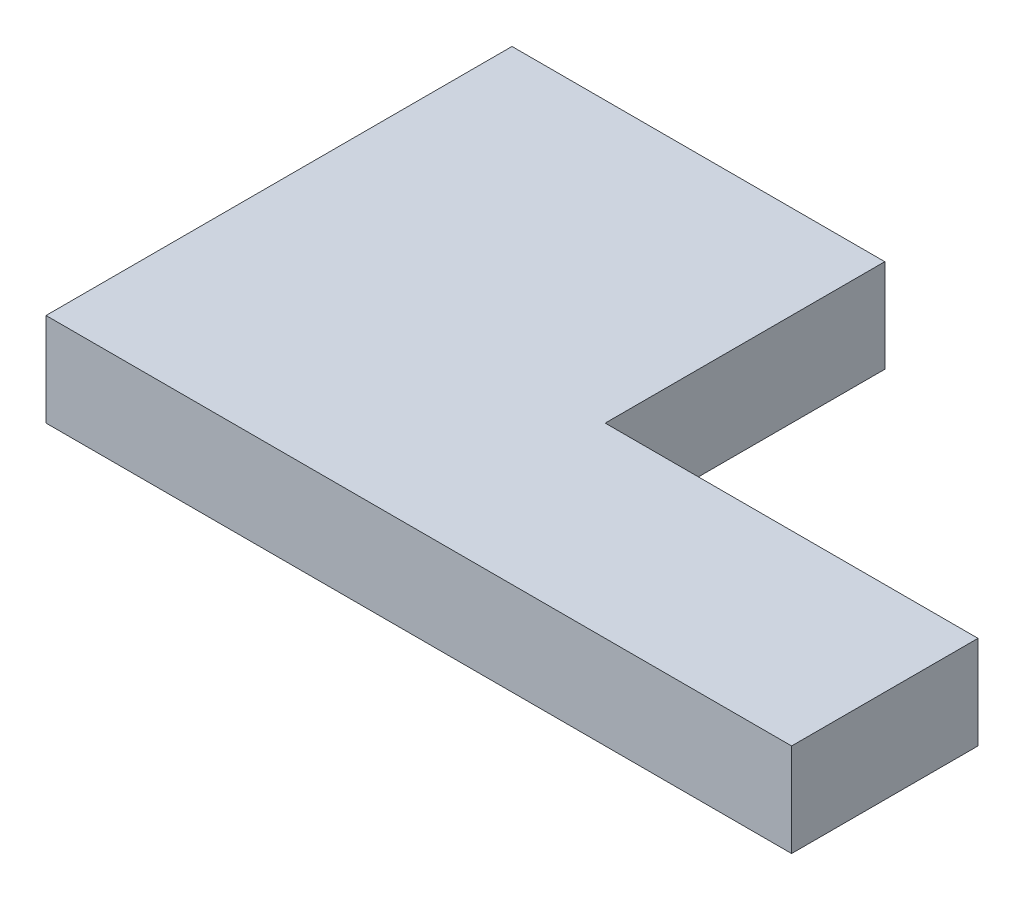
from build123d import *

# Parameters (mm, degrees)
BOSS_EXTRUDE1_DEPTH = 25


with BuildPart() as part:
    # Sketch1 → Boss-Extrude1 (new body)
    with BuildSketch(Plane.XZ):
        Polygon((0, 0), (200, 0), (200, -50), (100, -50), (100, -125), (0, -125), align=None)
    extrude(amount=-BOSS_EXTRUDE1_DEPTH)


solid = part.part
